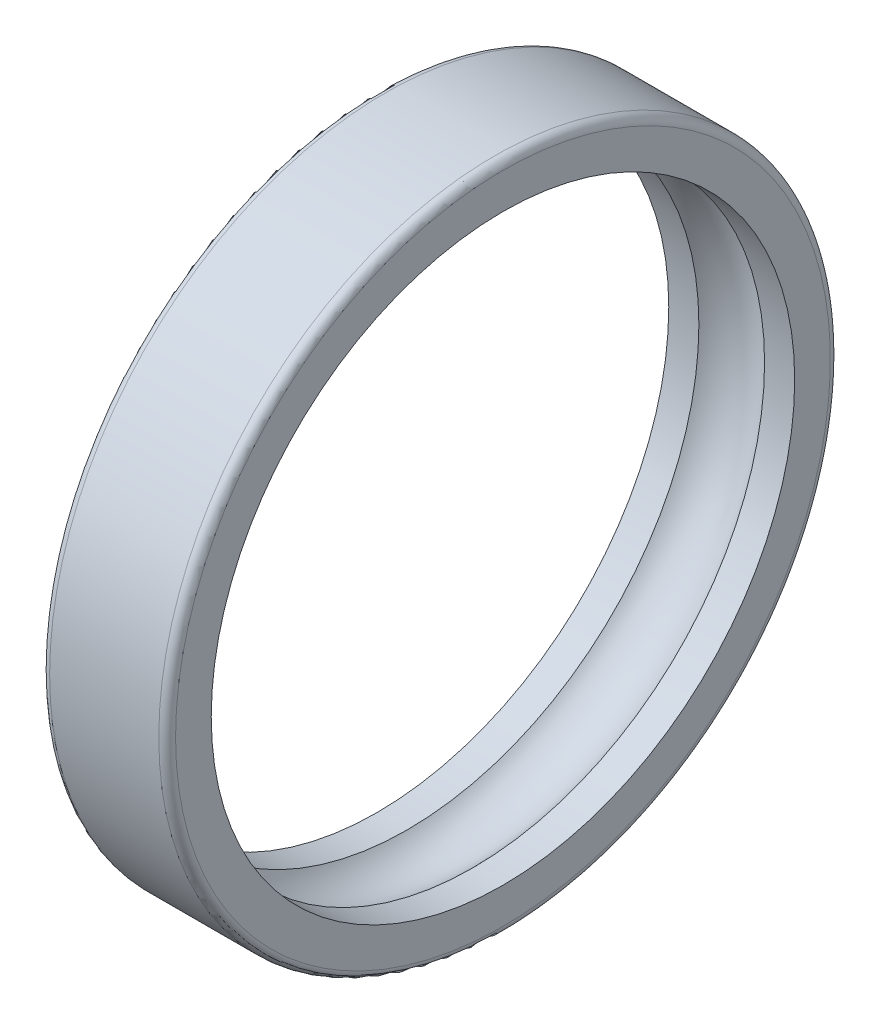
ISO-10303-21;
HEADER;
FILE_DESCRIPTION(('STEP AP214'),'2;1');
FILE_NAME('part.step','',(''),(''),'','','');
FILE_SCHEMA(('AUTOMOTIVE_DESIGN { 1 0 10303 214 1 1 1 1 }'));
ENDSEC;
DATA;
#1=APPLICATION_CONTEXT('core data for automotive mechanical design processes');
#2=APPLICATION_PROTOCOL_DEFINITION('international standard','automotive_design',2000,#1);
#3=PRODUCT_CONTEXT('',#1,'mechanical');
#4=PRODUCT('Part','Part','',(#3));
#5=PRODUCT_RELATED_PRODUCT_CATEGORY('part','',(#4));
#6=PRODUCT_DEFINITION_FORMATION('','',#4);
#7=PRODUCT_DEFINITION_CONTEXT('part definition',#1,'design');
#8=PRODUCT_DEFINITION('design','',#6,#7);
#9=PRODUCT_DEFINITION_SHAPE('','',#8);
#10=(LENGTH_UNIT() NAMED_UNIT(*) SI_UNIT(.MILLI.,.METRE.));
#11=(NAMED_UNIT(*) PLANE_ANGLE_UNIT() SI_UNIT($,.RADIAN.));
#12=(NAMED_UNIT(*) SI_UNIT($,.STERADIAN.) SOLID_ANGLE_UNIT());
#13=UNCERTAINTY_MEASURE_WITH_UNIT(LENGTH_MEASURE(1.E-05),#10,'distance_accuracy_value','');
#14=(GEOMETRIC_REPRESENTATION_CONTEXT(3) GLOBAL_UNCERTAINTY_ASSIGNED_CONTEXT((#13)) GLOBAL_UNIT_ASSIGNED_CONTEXT((#10,
#11,#12)) REPRESENTATION_CONTEXT('',''));
#15=CARTESIAN_POINT('',(0.,0.,0.));
#16=DIRECTION('',(0.,0.,1.));
#17=DIRECTION('',(1.,0.,0.));
#18=AXIS2_PLACEMENT_3D('',#15,#16,#17);
#19=CARTESIAN_POINT('',(1.99999999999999,0.,0.));
#20=DIRECTION('',(-1.,0.,0.));
#21=DIRECTION('',(0.,0.,1.));
#22=AXIS2_PLACEMENT_3D('',#19,#20,#21);
#23=TOROIDAL_SURFACE('',#22,78.,2.);
#24=CARTESIAN_POINT('',(0.,0.,0.));
#25=DIRECTION('',(-1.,0.,0.));
#26=DIRECTION('',(0.,0.,1.));
#27=AXIS2_PLACEMENT_3D('',#24,#25,#26);
#28=CIRCLE('',#27,78.);
#29=CARTESIAN_POINT('',(0.,0.,78.));
#30=VERTEX_POINT('',#29);
#31=EDGE_CURVE('E10',#30,#30,#28,.T.);
#32=ORIENTED_EDGE('',*,*,#31,.F.);
#33=EDGE_LOOP('',(#32));
#34=FACE_BOUND('',#33,.T.);
#35=CARTESIAN_POINT('',(1.99999999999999,0.,0.));
#36=DIRECTION('',(-1.,0.,0.));
#37=DIRECTION('',(0.,0.,1.));
#38=AXIS2_PLACEMENT_3D('',#35,#36,#37);
#39=CIRCLE('',#38,80.);
#40=CARTESIAN_POINT('',(1.99999999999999,0.,80.));
#41=VERTEX_POINT('',#40);
#42=EDGE_CURVE('E57',#41,#41,#39,.T.);
#43=ORIENTED_EDGE('',*,*,#42,.T.);
#44=EDGE_LOOP('',(#43));
#45=FACE_BOUND('',#44,.T.);
#46=ADVANCED_FACE('F29',(#34,#45),#23,.T.);
#47=CARTESIAN_POINT('',(0.,0.,-78.));
#48=DIRECTION('',(1.,0.,0.));
#49=DIRECTION('',(0.,0.,-1.));
#50=AXIS2_PLACEMENT_3D('',#47,#48,#49);
#51=PLANE('',#50);
#52=CARTESIAN_POINT('',(0.,0.,0.));
#53=DIRECTION('',(-1.,0.,0.));
#54=DIRECTION('',(0.,0.,1.));
#55=AXIS2_PLACEMENT_3D('',#52,#53,#54);
#56=CIRCLE('',#55,69.5);
#57=CARTESIAN_POINT('',(0.,0.,69.5));
#58=VERTEX_POINT('',#57);
#59=EDGE_CURVE('E35',#58,#58,#56,.T.);
#60=ORIENTED_EDGE('',*,*,#59,.F.);
#61=EDGE_LOOP('',(#60));
#62=FACE_BOUND('',#61,.T.);
#63=ORIENTED_EDGE('',*,*,#31,.T.);
#64=EDGE_LOOP('',(#63));
#65=FACE_BOUND('',#64,.T.);
#66=ADVANCED_FACE('F94',(#62,#65),#51,.F.);
#67=CARTESIAN_POINT('',(0.,0.,0.));
#68=DIRECTION('',(-1.,0.,0.));
#69=DIRECTION('',(0.,0.,1.));
#70=AXIS2_PLACEMENT_3D('',#67,#68,#69);
#71=CYLINDRICAL_SURFACE('',#70,69.5);
#72=CARTESIAN_POINT('',(7.17376207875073,0.,0.));
#73=DIRECTION('',(-1.,0.,0.));
#74=DIRECTION('',(0.,0.,1.));
#75=AXIS2_PLACEMENT_3D('',#72,#73,#74);
#76=CIRCLE('',#75,69.5);
#77=CARTESIAN_POINT('',(7.17376207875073,0.,69.5));
#78=VERTEX_POINT('',#77);
#79=EDGE_CURVE('E39',#78,#78,#76,.T.);
#80=ORIENTED_EDGE('',*,*,#79,.F.);
#81=EDGE_LOOP('',(#80));
#82=FACE_BOUND('',#81,.T.);
#83=ORIENTED_EDGE('',*,*,#59,.T.);
#84=EDGE_LOOP('',(#83));
#85=FACE_BOUND('',#84,.T.);
#86=ADVANCED_FACE('F89',(#82,#85),#71,.F.);
#87=CARTESIAN_POINT('',(15.,0.,0.));
#88=DIRECTION('',(-1.,0.,0.));
#89=DIRECTION('',(0.,0.,1.));
#90=AXIS2_PLACEMENT_3D('',#87,#88,#89);
#91=TOROIDAL_SURFACE('',#90,62.5,10.5);
#92=CARTESIAN_POINT('',(22.8262379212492,0.,0.));
#93=DIRECTION('',(-1.,0.,0.));
#94=DIRECTION('',(0.,0.,1.));
#95=AXIS2_PLACEMENT_3D('',#92,#93,#94);
#96=CIRCLE('',#95,69.5);
#97=CARTESIAN_POINT('',(22.8262379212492,0.,69.5));
#98=VERTEX_POINT('',#97);
#99=EDGE_CURVE('E43',#98,#98,#96,.T.);
#100=ORIENTED_EDGE('',*,*,#99,.F.);
#101=EDGE_LOOP('',(#100));
#102=FACE_BOUND('',#101,.T.);
#103=ORIENTED_EDGE('',*,*,#79,.T.);
#104=EDGE_LOOP('',(#103));
#105=FACE_BOUND('',#104,.T.);
#106=ADVANCED_FACE('F83',(#102,#105),#91,.F.);
#107=CARTESIAN_POINT('',(0.,0.,0.));
#108=DIRECTION('',(-1.,0.,0.));
#109=DIRECTION('',(0.,0.,1.));
#110=AXIS2_PLACEMENT_3D('',#107,#108,#109);
#111=CYLINDRICAL_SURFACE('',#110,69.5);
#112=CARTESIAN_POINT('',(30.,0.,0.));
#113=DIRECTION('',(-1.,0.,0.));
#114=DIRECTION('',(0.,0.,1.));
#115=AXIS2_PLACEMENT_3D('',#112,#113,#114);
#116=CIRCLE('',#115,69.5);
#117=CARTESIAN_POINT('',(30.,0.,69.5));
#118=VERTEX_POINT('',#117);
#119=EDGE_CURVE('E48',#118,#118,#116,.T.);
#120=ORIENTED_EDGE('',*,*,#119,.F.);
#121=EDGE_LOOP('',(#120));
#122=FACE_BOUND('',#121,.T.);
#123=ORIENTED_EDGE('',*,*,#99,.T.);
#124=EDGE_LOOP('',(#123));
#125=FACE_BOUND('',#124,.T.);
#126=ADVANCED_FACE('F77',(#122,#125),#111,.F.);
#127=CARTESIAN_POINT('',(30.,0.,-78.));
#128=DIRECTION('',(-1.,0.,0.));
#129=DIRECTION('',(0.,0.,1.));
#130=AXIS2_PLACEMENT_3D('',#127,#128,#129);
#131=PLANE('',#130);
#132=CARTESIAN_POINT('',(30.,0.,0.));
#133=DIRECTION('',(-1.,0.,0.));
#134=DIRECTION('',(0.,0.,1.));
#135=AXIS2_PLACEMENT_3D('',#132,#133,#134);
#136=CIRCLE('',#135,78.);
#137=CARTESIAN_POINT('',(30.,0.,78.));
#138=VERTEX_POINT('',#137);
#139=EDGE_CURVE('E51',#138,#138,#136,.T.);
#140=ORIENTED_EDGE('',*,*,#139,.F.);
#141=EDGE_LOOP('',(#140));
#142=FACE_BOUND('',#141,.T.);
#143=ORIENTED_EDGE('',*,*,#119,.T.);
#144=EDGE_LOOP('',(#143));
#145=FACE_BOUND('',#144,.T.);
#146=ADVANCED_FACE('F71',(#142,#145),#131,.F.);
#147=CARTESIAN_POINT('',(28.,0.,0.));
#148=DIRECTION('',(-1.,0.,0.));
#149=DIRECTION('',(0.,0.,1.));
#150=AXIS2_PLACEMENT_3D('',#147,#148,#149);
#151=TOROIDAL_SURFACE('',#150,78.,2.);
#152=CARTESIAN_POINT('',(28.,0.,0.));
#153=DIRECTION('',(-1.,0.,0.));
#154=DIRECTION('',(0.,0.,1.));
#155=AXIS2_PLACEMENT_3D('',#152,#153,#154);
#156=CIRCLE('',#155,80.);
#157=CARTESIAN_POINT('',(28.,0.,80.));
#158=VERTEX_POINT('',#157);
#159=EDGE_CURVE('E54',#158,#158,#156,.T.);
#160=ORIENTED_EDGE('',*,*,#159,.F.);
#161=EDGE_LOOP('',(#160));
#162=FACE_BOUND('',#161,.T.);
#163=ORIENTED_EDGE('',*,*,#139,.T.);
#164=EDGE_LOOP('',(#163));
#165=FACE_BOUND('',#164,.T.);
#166=ADVANCED_FACE('F65',(#162,#165),#151,.T.);
#167=CARTESIAN_POINT('',(0.,0.,0.));
#168=DIRECTION('',(-1.,0.,0.));
#169=DIRECTION('',(0.,0.,1.));
#170=AXIS2_PLACEMENT_3D('',#167,#168,#169);
#171=CYLINDRICAL_SURFACE('',#170,80.);
#172=ORIENTED_EDGE('',*,*,#42,.F.);
#173=EDGE_LOOP('',(#172));
#174=FACE_BOUND('',#173,.T.);
#175=ORIENTED_EDGE('',*,*,#159,.T.);
#176=EDGE_LOOP('',(#175));
#177=FACE_BOUND('',#176,.T.);
#178=ADVANCED_FACE('F62',(#174,#177),#171,.T.);
#179=CLOSED_SHELL('',(#46,#66,#86,#106,#126,#146,#166,#178));
#180=MANIFOLD_SOLID_BREP('B2',#179);
#181=ADVANCED_BREP_SHAPE_REPRESENTATION('',(#18,#180),#14);
#182=SHAPE_DEFINITION_REPRESENTATION(#9,#181);
ENDSEC;
END-ISO-10303-21;
